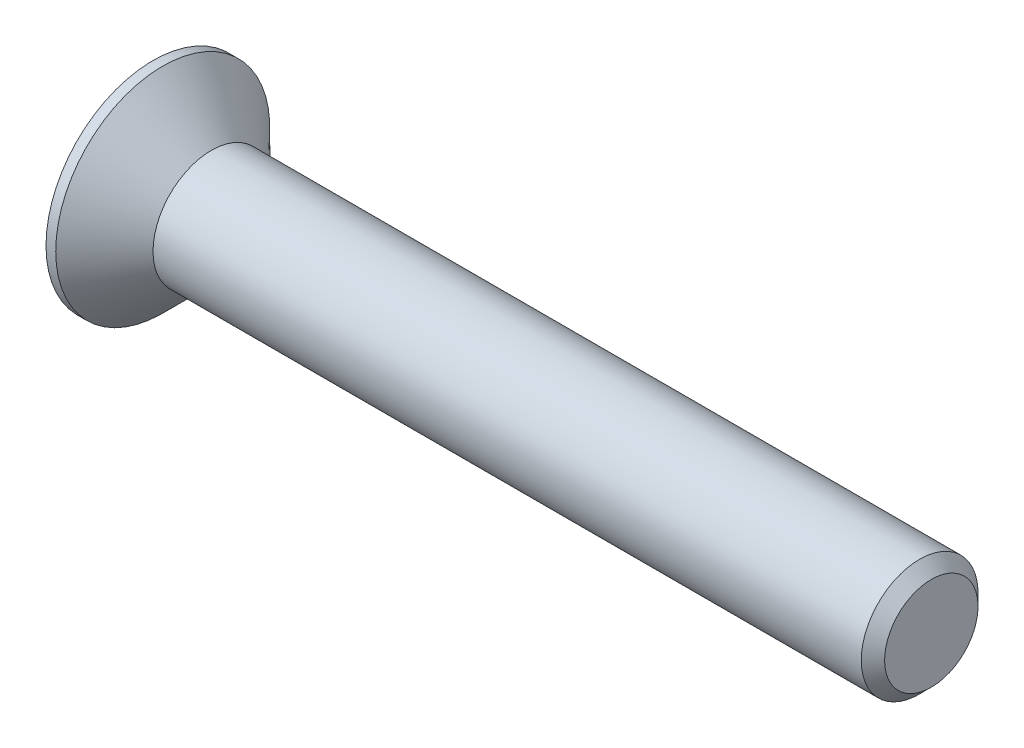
ISO-10303-21;
HEADER;
FILE_DESCRIPTION(('STEP AP214'),'2;1');
FILE_NAME('part.step','',(''),(''),'','','');
FILE_SCHEMA(('AUTOMOTIVE_DESIGN { 1 0 10303 214 1 1 1 1 }'));
ENDSEC;
DATA;
#1=APPLICATION_CONTEXT('core data for automotive mechanical design processes');
#2=APPLICATION_PROTOCOL_DEFINITION('international standard','automotive_design',2000,#1);
#3=PRODUCT_CONTEXT('',#1,'mechanical');
#4=PRODUCT('Part','Part','',(#3));
#5=PRODUCT_RELATED_PRODUCT_CATEGORY('part','',(#4));
#6=PRODUCT_DEFINITION_FORMATION('','',#4);
#7=PRODUCT_DEFINITION_CONTEXT('part definition',#1,'design');
#8=PRODUCT_DEFINITION('design','',#6,#7);
#9=PRODUCT_DEFINITION_SHAPE('','',#8);
#10=(LENGTH_UNIT() NAMED_UNIT(*) SI_UNIT(.MILLI.,.METRE.));
#11=(NAMED_UNIT(*) PLANE_ANGLE_UNIT() SI_UNIT($,.RADIAN.));
#12=(NAMED_UNIT(*) SI_UNIT($,.STERADIAN.) SOLID_ANGLE_UNIT());
#13=UNCERTAINTY_MEASURE_WITH_UNIT(LENGTH_MEASURE(1.E-05),#10,'distance_accuracy_value','');
#14=(GEOMETRIC_REPRESENTATION_CONTEXT(3) GLOBAL_UNCERTAINTY_ASSIGNED_CONTEXT((#13)) GLOBAL_UNIT_ASSIGNED_CONTEXT((#10,
#11,#12)) REPRESENTATION_CONTEXT('',''));
#15=CARTESIAN_POINT('',(0.,0.,0.));
#16=DIRECTION('',(0.,0.,1.));
#17=DIRECTION('',(1.,0.,0.));
#18=AXIS2_PLACEMENT_3D('',#15,#16,#17);
#19=CARTESIAN_POINT('',(0.,0.,0.));
#20=DIRECTION('',(-1.,0.,0.));
#21=DIRECTION('',(0.,0.,1.));
#22=AXIS2_PLACEMENT_3D('',#19,#20,#21);
#23=CONICAL_SURFACE('',#22,3.,0.78539816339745);
#24=CARTESIAN_POINT('',(-2.49999999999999,0.,0.));
#25=DIRECTION('',(-1.,0.,0.));
#26=DIRECTION('',(0.,0.,1.));
#27=AXIS2_PLACEMENT_3D('',#24,#25,#26);
#28=CIRCLE('',#27,5.5);
#29=CARTESIAN_POINT('',(-2.49999999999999,0.,5.5));
#30=VERTEX_POINT('',#29);
#31=EDGE_CURVE('E189',#30,#30,#28,.T.);
#32=ORIENTED_EDGE('',*,*,#31,.F.);
#33=EDGE_LOOP('',(#32));
#34=FACE_BOUND('',#33,.T.);
#35=CARTESIAN_POINT('',(0.,0.,0.));
#36=DIRECTION('',(-1.,0.,0.));
#37=DIRECTION('',(0.,0.,1.));
#38=AXIS2_PLACEMENT_3D('',#35,#36,#37);
#39=CIRCLE('',#38,3.);
#40=CARTESIAN_POINT('',(0.,0.,3.));
#41=VERTEX_POINT('',#40);
#42=EDGE_CURVE('E212',#41,#41,#39,.T.);
#43=ORIENTED_EDGE('',*,*,#42,.T.);
#44=EDGE_LOOP('',(#43));
#45=FACE_BOUND('',#44,.T.);
#46=ADVANCED_FACE('F33',(#34,#45),#23,.T.);
#47=CARTESIAN_POINT('',(-3.,0.,0.));
#48=DIRECTION('',(-1.,0.,0.));
#49=DIRECTION('',(0.,0.,1.));
#50=AXIS2_PLACEMENT_3D('',#47,#48,#49);
#51=CYLINDRICAL_SURFACE('',#50,3.);
#52=CARTESIAN_POINT('',(36.4,0.,0.));
#53=DIRECTION('',(-1.,0.,0.));
#54=DIRECTION('',(0.,0.,1.));
#55=AXIS2_PLACEMENT_3D('',#52,#53,#54);
#56=CIRCLE('',#55,3.);
#57=CARTESIAN_POINT('',(36.4,0.,3.));
#58=VERTEX_POINT('',#57);
#59=EDGE_CURVE('E41',#58,#58,#56,.T.);
#60=ORIENTED_EDGE('',*,*,#59,.T.);
#61=EDGE_LOOP('',(#60));
#62=FACE_BOUND('',#61,.T.);
#63=ORIENTED_EDGE('',*,*,#42,.F.);
#64=EDGE_LOOP('',(#63));
#65=FACE_BOUND('',#64,.T.);
#66=ADVANCED_FACE('F217',(#62,#65),#51,.T.);
#67=CARTESIAN_POINT('',(37.,0.,0.));
#68=DIRECTION('',(-1.,0.,0.));
#69=DIRECTION('',(0.,0.,1.));
#70=AXIS2_PLACEMENT_3D('',#67,#68,#69);
#71=PLANE('',#70);
#72=CARTESIAN_POINT('',(37.,0.,0.));
#73=DIRECTION('',(-1.,0.,0.));
#74=DIRECTION('',(0.,0.,1.));
#75=AXIS2_PLACEMENT_3D('',#72,#73,#74);
#76=CIRCLE('',#75,2.39999999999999);
#77=CARTESIAN_POINT('',(37.,0.,2.39999999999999));
#78=VERTEX_POINT('',#77);
#79=EDGE_CURVE('E11',#78,#78,#76,.F.);
#80=ORIENTED_EDGE('',*,*,#79,.T.);
#81=EDGE_LOOP('',(#80));
#82=FACE_BOUND('',#81,.T.);
#83=ADVANCED_FACE('F239',(#82),#71,.F.);
#84=CARTESIAN_POINT('',(-3.,5.5,0.));
#85=DIRECTION('',(1.,0.,0.));
#86=DIRECTION('',(0.,0.,-1.));
#87=AXIS2_PLACEMENT_3D('',#84,#85,#86);
#88=PLANE('',#87);
#89=DIRECTION('',(0.,0.,-1.));
#90=VECTOR('',#89,1.);
#91=CARTESIAN_POINT('',(-3.,0.825,-3.3));
#92=LINE('',#91,#90);
#93=CARTESIAN_POINT('',(-3.,0.825,-0.825));
#94=VERTEX_POINT('',#93);
#95=CARTESIAN_POINT('',(-3.,0.825,-3.3));
#96=VERTEX_POINT('',#95);
#97=EDGE_CURVE('E158',#94,#96,#92,.T.);
#98=ORIENTED_EDGE('',*,*,#97,.F.);
#99=DIRECTION('',(0.,-1.,0.));
#100=VECTOR('',#99,1.);
#101=CARTESIAN_POINT('',(-3.,0.825,-0.825));
#102=LINE('',#101,#100);
#103=CARTESIAN_POINT('',(-3.,3.3,-0.825));
#104=VERTEX_POINT('',#103);
#105=EDGE_CURVE('E48',#104,#94,#102,.T.);
#106=ORIENTED_EDGE('',*,*,#105,.F.);
#107=DIRECTION('',(0.,0.,-1.));
#108=VECTOR('',#107,1.);
#109=CARTESIAN_POINT('',(-3.,3.3,-0.825));
#110=LINE('',#109,#108);
#111=CARTESIAN_POINT('',(-3.,3.3,0.825));
#112=VERTEX_POINT('',#111);
#113=EDGE_CURVE('E185',#112,#104,#110,.T.);
#114=ORIENTED_EDGE('',*,*,#113,.F.);
#115=DIRECTION('',(0.,1.,0.));
#116=VECTOR('',#115,1.);
#117=CARTESIAN_POINT('',(-3.,3.3,0.825));
#118=LINE('',#117,#116);
#119=CARTESIAN_POINT('',(-3.,0.825,0.825));
#120=VERTEX_POINT('',#119);
#121=EDGE_CURVE('E183',#120,#112,#118,.T.);
#122=ORIENTED_EDGE('',*,*,#121,.F.);
#123=DIRECTION('',(0.,0.,-1.));
#124=VECTOR('',#123,1.);
#125=CARTESIAN_POINT('',(-3.,0.825,0.825));
#126=LINE('',#125,#124);
#127=CARTESIAN_POINT('',(-3.,0.825,3.3));
#128=VERTEX_POINT('',#127);
#129=EDGE_CURVE('E132',#128,#120,#126,.T.);
#130=ORIENTED_EDGE('',*,*,#129,.F.);
#131=DIRECTION('',(0.,1.,0.));
#132=VECTOR('',#131,1.);
#133=CARTESIAN_POINT('',(-3.,0.825,3.3));
#134=LINE('',#133,#132);
#135=CARTESIAN_POINT('',(-3.,-0.825,3.3));
#136=VERTEX_POINT('',#135);
#137=EDGE_CURVE('E179',#136,#128,#134,.T.);
#138=ORIENTED_EDGE('',*,*,#137,.F.);
#139=DIRECTION('',(0.,0.,1.));
#140=VECTOR('',#139,1.);
#141=CARTESIAN_POINT('',(-3.,-0.825,3.3));
#142=LINE('',#141,#140);
#143=CARTESIAN_POINT('',(-3.,-0.825,0.825));
#144=VERTEX_POINT('',#143);
#145=EDGE_CURVE('E176',#144,#136,#142,.T.);
#146=ORIENTED_EDGE('',*,*,#145,.F.);
#147=DIRECTION('',(0.,1.,0.));
#148=VECTOR('',#147,1.);
#149=CARTESIAN_POINT('',(-3.,-0.825,0.825));
#150=LINE('',#149,#148);
#151=CARTESIAN_POINT('',(-3.,-3.3,0.825));
#152=VERTEX_POINT('',#151);
#153=EDGE_CURVE('E173',#152,#144,#150,.T.);
#154=ORIENTED_EDGE('',*,*,#153,.F.);
#155=DIRECTION('',(0.,0.,1.));
#156=VECTOR('',#155,1.);
#157=CARTESIAN_POINT('',(-3.,-3.3,0.825));
#158=LINE('',#157,#156);
#159=CARTESIAN_POINT('',(-3.,-3.3,-0.825));
#160=VERTEX_POINT('',#159);
#161=EDGE_CURVE('E170',#160,#152,#158,.T.);
#162=ORIENTED_EDGE('',*,*,#161,.F.);
#163=DIRECTION('',(0.,-1.,0.));
#164=VECTOR('',#163,1.);
#165=CARTESIAN_POINT('',(-3.,-3.3,-0.825));
#166=LINE('',#165,#164);
#167=CARTESIAN_POINT('',(-3.,-0.825,-0.825));
#168=VERTEX_POINT('',#167);
#169=EDGE_CURVE('E167',#168,#160,#166,.T.);
#170=ORIENTED_EDGE('',*,*,#169,.F.);
#171=DIRECTION('',(0.,0.,1.));
#172=VECTOR('',#171,1.);
#173=CARTESIAN_POINT('',(-3.,-0.825,-0.825));
#174=LINE('',#173,#172);
#175=CARTESIAN_POINT('',(-3.,-0.825,-3.3));
#176=VERTEX_POINT('',#175);
#177=EDGE_CURVE('E164',#176,#168,#174,.T.);
#178=ORIENTED_EDGE('',*,*,#177,.F.);
#179=DIRECTION('',(0.,-1.,0.));
#180=VECTOR('',#179,1.);
#181=CARTESIAN_POINT('',(-3.,-0.825,-3.3));
#182=LINE('',#181,#180);
#183=EDGE_CURVE('E161',#96,#176,#182,.T.);
#184=ORIENTED_EDGE('',*,*,#183,.F.);
#185=EDGE_LOOP('',(#98,#106,#114,#122,#130,#138,#146,#154,#162,#170,#178,#184));
#186=FACE_BOUND('',#185,.T.);
#187=CARTESIAN_POINT('',(-3.,0.,0.));
#188=DIRECTION('',(-1.,0.,0.));
#189=DIRECTION('',(0.,0.,1.));
#190=AXIS2_PLACEMENT_3D('',#187,#188,#189);
#191=CIRCLE('',#190,5.5);
#192=CARTESIAN_POINT('',(-3.,0.,5.5));
#193=VERTEX_POINT('',#192);
#194=EDGE_CURVE('E209',#193,#193,#191,.T.);
#195=ORIENTED_EDGE('',*,*,#194,.T.);
#196=EDGE_LOOP('',(#195));
#197=FACE_BOUND('',#196,.T.);
#198=ADVANCED_FACE('F230',(#186,#197),#88,.F.);
#199=CARTESIAN_POINT('',(-3.,0.,0.));
#200=DIRECTION('',(-1.,0.,0.));
#201=DIRECTION('',(0.,0.,1.));
#202=AXIS2_PLACEMENT_3D('',#199,#200,#201);
#203=CYLINDRICAL_SURFACE('',#202,5.5);
#204=ORIENTED_EDGE('',*,*,#194,.F.);
#205=EDGE_LOOP('',(#204));
#206=FACE_BOUND('',#205,.T.);
#207=ORIENTED_EDGE('',*,*,#31,.T.);
#208=EDGE_LOOP('',(#207));
#209=FACE_BOUND('',#208,.T.);
#210=ADVANCED_FACE('F222',(#206,#209),#203,.T.);
#211=CARTESIAN_POINT('',(36.4,0.,0.));
#212=DIRECTION('',(-1.,0.,0.));
#213=DIRECTION('',(0.,0.,1.));
#214=AXIS2_PLACEMENT_3D('',#211,#212,#213);
#215=CONICAL_SURFACE('',#214,3.,0.785398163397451);
#216=ORIENTED_EDGE('',*,*,#79,.F.);
#217=EDGE_LOOP('',(#216));
#218=FACE_BOUND('',#217,.T.);
#219=ORIENTED_EDGE('',*,*,#59,.F.);
#220=EDGE_LOOP('',(#219));
#221=FACE_BOUND('',#220,.T.);
#222=ADVANCED_FACE('F35',(#218,#221),#215,.T.);
#223=CARTESIAN_POINT('',(-0.5,0.825,-0.825));
#224=DIRECTION('',(0.,0.,-1.));
#225=DIRECTION('',(-1.,0.,0.));
#226=AXIS2_PLACEMENT_3D('',#223,#224,#225);
#227=PLANE('',#226);
#228=ORIENTED_EDGE('',*,*,#105,.T.);
#229=DIRECTION('',(-1.,0.,0.));
#230=VECTOR('',#229,1.);
#231=CARTESIAN_POINT('',(-0.5,0.825,-0.825));
#232=LINE('',#231,#230);
#233=CARTESIAN_POINT('',(-0.5,0.825,-0.825));
#234=VERTEX_POINT('',#233);
#235=EDGE_CURVE('E96',#234,#94,#232,.T.);
#236=ORIENTED_EDGE('',*,*,#235,.F.);
#237=DIRECTION('',(0.,-1.,0.));
#238=VECTOR('',#237,1.);
#239=CARTESIAN_POINT('',(-0.5,0.825,-0.825));
#240=LINE('',#239,#238);
#241=CARTESIAN_POINT('',(-0.5,3.3,-0.825));
#242=VERTEX_POINT('',#241);
#243=EDGE_CURVE('E187',#242,#234,#240,.T.);
#244=ORIENTED_EDGE('',*,*,#243,.F.);
#245=DIRECTION('',(-1.,0.,0.));
#246=VECTOR('',#245,1.);
#247=CARTESIAN_POINT('',(-0.5,3.3,-0.825));
#248=LINE('',#247,#246);
#249=EDGE_CURVE('E56',#242,#104,#248,.T.);
#250=ORIENTED_EDGE('',*,*,#249,.T.);
#251=EDGE_LOOP('',(#228,#236,#244,#250));
#252=FACE_BOUND('',#251,.T.);
#253=ADVANCED_FACE('F221',(#252),#227,.F.);
#254=CARTESIAN_POINT('',(-0.5,3.3,-0.825));
#255=DIRECTION('',(0.,1.,0.));
#256=DIRECTION('',(-1.,0.,0.));
#257=AXIS2_PLACEMENT_3D('',#254,#255,#256);
#258=PLANE('',#257);
#259=ORIENTED_EDGE('',*,*,#113,.T.);
#260=ORIENTED_EDGE('',*,*,#249,.F.);
#261=DIRECTION('',(0.,0.,-1.));
#262=VECTOR('',#261,1.);
#263=CARTESIAN_POINT('',(-0.5,3.3,-0.825));
#264=LINE('',#263,#262);
#265=CARTESIAN_POINT('',(-0.5,3.3,0.825));
#266=VERTEX_POINT('',#265);
#267=EDGE_CURVE('E144',#266,#242,#264,.T.);
#268=ORIENTED_EDGE('',*,*,#267,.F.);
#269=DIRECTION('',(-1.,0.,0.));
#270=VECTOR('',#269,1.);
#271=CARTESIAN_POINT('',(-0.5,3.3,0.825));
#272=LINE('',#271,#270);
#273=EDGE_CURVE('E136',#266,#112,#272,.T.);
#274=ORIENTED_EDGE('',*,*,#273,.T.);
#275=EDGE_LOOP('',(#259,#260,#268,#274));
#276=FACE_BOUND('',#275,.T.);
#277=ADVANCED_FACE('F228',(#276),#258,.F.);
#278=CARTESIAN_POINT('',(-0.5,3.3,0.825));
#279=DIRECTION('',(0.,0.,1.));
#280=DIRECTION('',(1.,0.,0.));
#281=AXIS2_PLACEMENT_3D('',#278,#279,#280);
#282=PLANE('',#281);
#283=ORIENTED_EDGE('',*,*,#121,.T.);
#284=ORIENTED_EDGE('',*,*,#273,.F.);
#285=DIRECTION('',(0.,1.,0.));
#286=VECTOR('',#285,1.);
#287=CARTESIAN_POINT('',(-0.5,3.3,0.825));
#288=LINE('',#287,#286);
#289=CARTESIAN_POINT('',(-0.5,0.825,0.825));
#290=VERTEX_POINT('',#289);
#291=EDGE_CURVE('E140',#290,#266,#288,.T.);
#292=ORIENTED_EDGE('',*,*,#291,.F.);
#293=DIRECTION('',(-1.,0.,0.));
#294=VECTOR('',#293,1.);
#295=CARTESIAN_POINT('',(-0.5,0.825,0.825));
#296=LINE('',#295,#294);
#297=EDGE_CURVE('E125',#290,#120,#296,.T.);
#298=ORIENTED_EDGE('',*,*,#297,.T.);
#299=EDGE_LOOP('',(#283,#284,#292,#298));
#300=FACE_BOUND('',#299,.T.);
#301=ADVANCED_FACE('F141',(#300),#282,.F.);
#302=CARTESIAN_POINT('',(-0.5,0.825,0.825));
#303=DIRECTION('',(0.,1.,0.));
#304=DIRECTION('',(-1.,0.,0.));
#305=AXIS2_PLACEMENT_3D('',#302,#303,#304);
#306=PLANE('',#305);
#307=ORIENTED_EDGE('',*,*,#129,.T.);
#308=ORIENTED_EDGE('',*,*,#297,.F.);
#309=DIRECTION('',(0.,0.,-1.));
#310=VECTOR('',#309,1.);
#311=CARTESIAN_POINT('',(-0.5,0.825,0.825));
#312=LINE('',#311,#310);
#313=CARTESIAN_POINT('',(-0.5,0.825,3.3));
#314=VERTEX_POINT('',#313);
#315=EDGE_CURVE('E129',#314,#290,#312,.T.);
#316=ORIENTED_EDGE('',*,*,#315,.F.);
#317=DIRECTION('',(-1.,0.,0.));
#318=VECTOR('',#317,1.);
#319=CARTESIAN_POINT('',(-0.5,0.825,3.3));
#320=LINE('',#319,#318);
#321=EDGE_CURVE('E137',#314,#128,#320,.T.);
#322=ORIENTED_EDGE('',*,*,#321,.T.);
#323=EDGE_LOOP('',(#307,#308,#316,#322));
#324=FACE_BOUND('',#323,.T.);
#325=ADVANCED_FACE('F127',(#324),#306,.F.);
#326=CARTESIAN_POINT('',(-0.5,0.825,3.3));
#327=DIRECTION('',(0.,0.,1.));
#328=DIRECTION('',(1.,0.,0.));
#329=AXIS2_PLACEMENT_3D('',#326,#327,#328);
#330=PLANE('',#329);
#331=ORIENTED_EDGE('',*,*,#137,.T.);
#332=ORIENTED_EDGE('',*,*,#321,.F.);
#333=DIRECTION('',(0.,1.,0.));
#334=VECTOR('',#333,1.);
#335=CARTESIAN_POINT('',(-0.5,0.825,3.3));
#336=LINE('',#335,#334);
#337=CARTESIAN_POINT('',(-0.5,-0.825,3.3));
#338=VERTEX_POINT('',#337);
#339=EDGE_CURVE('E150',#338,#314,#336,.T.);
#340=ORIENTED_EDGE('',*,*,#339,.F.);
#341=DIRECTION('',(-1.,0.,0.));
#342=VECTOR('',#341,1.);
#343=CARTESIAN_POINT('',(-0.5,-0.825,3.3));
#344=LINE('',#343,#342);
#345=EDGE_CURVE('E192',#338,#136,#344,.T.);
#346=ORIENTED_EDGE('',*,*,#345,.T.);
#347=EDGE_LOOP('',(#331,#332,#340,#346));
#348=FACE_BOUND('',#347,.T.);
#349=ADVANCED_FACE('F277',(#348),#330,.F.);
#350=CARTESIAN_POINT('',(-0.5,-0.825,3.3));
#351=DIRECTION('',(0.,-1.,0.));
#352=DIRECTION('',(1.,0.,0.));
#353=AXIS2_PLACEMENT_3D('',#350,#351,#352);
#354=PLANE('',#353);
#355=ORIENTED_EDGE('',*,*,#145,.T.);
#356=ORIENTED_EDGE('',*,*,#345,.F.);
#357=DIRECTION('',(0.,0.,1.));
#358=VECTOR('',#357,1.);
#359=CARTESIAN_POINT('',(-0.5,-0.825,3.3));
#360=LINE('',#359,#358);
#361=CARTESIAN_POINT('',(-0.5,-0.825,0.825));
#362=VERTEX_POINT('',#361);
#363=EDGE_CURVE('E152',#362,#338,#360,.T.);
#364=ORIENTED_EDGE('',*,*,#363,.F.);
#365=DIRECTION('',(-1.,0.,0.));
#366=VECTOR('',#365,1.);
#367=CARTESIAN_POINT('',(-0.5,-0.825,0.825));
#368=LINE('',#367,#366);
#369=EDGE_CURVE('E194',#362,#144,#368,.T.);
#370=ORIENTED_EDGE('',*,*,#369,.T.);
#371=EDGE_LOOP('',(#355,#356,#364,#370));
#372=FACE_BOUND('',#371,.T.);
#373=ADVANCED_FACE('F273',(#372),#354,.F.);
#374=CARTESIAN_POINT('',(-0.5,-0.825,0.825));
#375=DIRECTION('',(0.,0.,1.));
#376=DIRECTION('',(1.,0.,0.));
#377=AXIS2_PLACEMENT_3D('',#374,#375,#376);
#378=PLANE('',#377);
#379=ORIENTED_EDGE('',*,*,#153,.T.);
#380=ORIENTED_EDGE('',*,*,#369,.F.);
#381=DIRECTION('',(0.,1.,0.));
#382=VECTOR('',#381,1.);
#383=CARTESIAN_POINT('',(-0.5,-0.825,0.825));
#384=LINE('',#383,#382);
#385=CARTESIAN_POINT('',(-0.5,-3.3,0.825));
#386=VERTEX_POINT('',#385);
#387=EDGE_CURVE('E422',#386,#362,#384,.T.);
#388=ORIENTED_EDGE('',*,*,#387,.F.);
#389=DIRECTION('',(-1.,0.,0.));
#390=VECTOR('',#389,1.);
#391=CARTESIAN_POINT('',(-0.5,-3.3,0.825));
#392=LINE('',#391,#390);
#393=EDGE_CURVE('E196',#386,#152,#392,.T.);
#394=ORIENTED_EDGE('',*,*,#393,.T.);
#395=EDGE_LOOP('',(#379,#380,#388,#394));
#396=FACE_BOUND('',#395,.T.);
#397=ADVANCED_FACE('F269',(#396),#378,.F.);
#398=CARTESIAN_POINT('',(-0.5,-3.3,0.825));
#399=DIRECTION('',(0.,-1.,0.));
#400=DIRECTION('',(1.,0.,0.));
#401=AXIS2_PLACEMENT_3D('',#398,#399,#400);
#402=PLANE('',#401);
#403=ORIENTED_EDGE('',*,*,#161,.T.);
#404=ORIENTED_EDGE('',*,*,#393,.F.);
#405=DIRECTION('',(0.,0.,1.));
#406=VECTOR('',#405,1.);
#407=CARTESIAN_POINT('',(-0.5,-3.3,0.825));
#408=LINE('',#407,#406);
#409=CARTESIAN_POINT('',(-0.5,-3.3,-0.825));
#410=VERTEX_POINT('',#409);
#411=EDGE_CURVE('E419',#410,#386,#408,.T.);
#412=ORIENTED_EDGE('',*,*,#411,.F.);
#413=DIRECTION('',(-1.,0.,0.));
#414=VECTOR('',#413,1.);
#415=CARTESIAN_POINT('',(-0.5,-3.3,-0.825));
#416=LINE('',#415,#414);
#417=EDGE_CURVE('E198',#410,#160,#416,.T.);
#418=ORIENTED_EDGE('',*,*,#417,.T.);
#419=EDGE_LOOP('',(#403,#404,#412,#418));
#420=FACE_BOUND('',#419,.T.);
#421=ADVANCED_FACE('F265',(#420),#402,.F.);
#422=CARTESIAN_POINT('',(-0.5,-3.3,-0.825));
#423=DIRECTION('',(0.,0.,-1.));
#424=DIRECTION('',(-1.,0.,0.));
#425=AXIS2_PLACEMENT_3D('',#422,#423,#424);
#426=PLANE('',#425);
#427=ORIENTED_EDGE('',*,*,#169,.T.);
#428=ORIENTED_EDGE('',*,*,#417,.F.);
#429=DIRECTION('',(0.,-1.,0.));
#430=VECTOR('',#429,1.);
#431=CARTESIAN_POINT('',(-0.5,-3.3,-0.825));
#432=LINE('',#431,#430);
#433=CARTESIAN_POINT('',(-0.5,-0.825,-0.825));
#434=VERTEX_POINT('',#433);
#435=EDGE_CURVE('E416',#434,#410,#432,.T.);
#436=ORIENTED_EDGE('',*,*,#435,.F.);
#437=DIRECTION('',(-1.,0.,0.));
#438=VECTOR('',#437,1.);
#439=CARTESIAN_POINT('',(-0.5,-0.825,-0.825));
#440=LINE('',#439,#438);
#441=EDGE_CURVE('E200',#434,#168,#440,.T.);
#442=ORIENTED_EDGE('',*,*,#441,.T.);
#443=EDGE_LOOP('',(#427,#428,#436,#442));
#444=FACE_BOUND('',#443,.T.);
#445=ADVANCED_FACE('F261',(#444),#426,.F.);
#446=CARTESIAN_POINT('',(-0.5,-0.825,-0.825));
#447=DIRECTION('',(0.,-1.,0.));
#448=DIRECTION('',(1.,0.,0.));
#449=AXIS2_PLACEMENT_3D('',#446,#447,#448);
#450=PLANE('',#449);
#451=ORIENTED_EDGE('',*,*,#177,.T.);
#452=ORIENTED_EDGE('',*,*,#441,.F.);
#453=DIRECTION('',(0.,0.,1.));
#454=VECTOR('',#453,1.);
#455=CARTESIAN_POINT('',(-0.5,-0.825,-0.825));
#456=LINE('',#455,#454);
#457=CARTESIAN_POINT('',(-0.5,-0.825,-3.3));
#458=VERTEX_POINT('',#457);
#459=EDGE_CURVE('E413',#458,#434,#456,.T.);
#460=ORIENTED_EDGE('',*,*,#459,.F.);
#461=DIRECTION('',(-1.,0.,0.));
#462=VECTOR('',#461,1.);
#463=CARTESIAN_POINT('',(-0.5,-0.825,-3.3));
#464=LINE('',#463,#462);
#465=EDGE_CURVE('E202',#458,#176,#464,.T.);
#466=ORIENTED_EDGE('',*,*,#465,.T.);
#467=EDGE_LOOP('',(#451,#452,#460,#466));
#468=FACE_BOUND('',#467,.T.);
#469=ADVANCED_FACE('F257',(#468),#450,.F.);
#470=CARTESIAN_POINT('',(-0.5,-0.825,-3.3));
#471=DIRECTION('',(0.,0.,-1.));
#472=DIRECTION('',(-1.,0.,0.));
#473=AXIS2_PLACEMENT_3D('',#470,#471,#472);
#474=PLANE('',#473);
#475=ORIENTED_EDGE('',*,*,#183,.T.);
#476=ORIENTED_EDGE('',*,*,#465,.F.);
#477=DIRECTION('',(0.,-1.,0.));
#478=VECTOR('',#477,1.);
#479=CARTESIAN_POINT('',(-0.5,-0.825,-3.3));
#480=LINE('',#479,#478);
#481=CARTESIAN_POINT('',(-0.5,0.825,-3.3));
#482=VERTEX_POINT('',#481);
#483=EDGE_CURVE('E408',#482,#458,#480,.T.);
#484=ORIENTED_EDGE('',*,*,#483,.F.);
#485=DIRECTION('',(-1.,0.,0.));
#486=VECTOR('',#485,1.);
#487=CARTESIAN_POINT('',(-0.5,0.825,-3.3));
#488=LINE('',#487,#486);
#489=EDGE_CURVE('E204',#482,#96,#488,.T.);
#490=ORIENTED_EDGE('',*,*,#489,.T.);
#491=EDGE_LOOP('',(#475,#476,#484,#490));
#492=FACE_BOUND('',#491,.T.);
#493=ADVANCED_FACE('F253',(#492),#474,.F.);
#494=CARTESIAN_POINT('',(-0.5,0.825,-3.3));
#495=DIRECTION('',(0.,1.,0.));
#496=DIRECTION('',(-1.,0.,0.));
#497=AXIS2_PLACEMENT_3D('',#494,#495,#496);
#498=PLANE('',#497);
#499=ORIENTED_EDGE('',*,*,#97,.T.);
#500=ORIENTED_EDGE('',*,*,#489,.F.);
#501=DIRECTION('',(0.,0.,-1.));
#502=VECTOR('',#501,1.);
#503=CARTESIAN_POINT('',(-0.5,0.825,-3.3));
#504=LINE('',#503,#502);
#505=EDGE_CURVE('E406',#234,#482,#504,.T.);
#506=ORIENTED_EDGE('',*,*,#505,.F.);
#507=ORIENTED_EDGE('',*,*,#235,.T.);
#508=EDGE_LOOP('',(#499,#500,#506,#507));
#509=FACE_BOUND('',#508,.T.);
#510=ADVANCED_FACE('F250',(#509),#498,.F.);
#511=CARTESIAN_POINT('',(-0.5,0.,0.));
#512=DIRECTION('',(1.,0.,0.));
#513=DIRECTION('',(0.,0.,-1.));
#514=AXIS2_PLACEMENT_3D('',#511,#512,#513);
#515=PLANE('',#514);
#516=ORIENTED_EDGE('',*,*,#243,.T.);
#517=ORIENTED_EDGE('',*,*,#505,.T.);
#518=ORIENTED_EDGE('',*,*,#483,.T.);
#519=ORIENTED_EDGE('',*,*,#459,.T.);
#520=ORIENTED_EDGE('',*,*,#435,.T.);
#521=ORIENTED_EDGE('',*,*,#411,.T.);
#522=ORIENTED_EDGE('',*,*,#387,.T.);
#523=ORIENTED_EDGE('',*,*,#363,.T.);
#524=ORIENTED_EDGE('',*,*,#339,.T.);
#525=ORIENTED_EDGE('',*,*,#315,.T.);
#526=ORIENTED_EDGE('',*,*,#291,.T.);
#527=ORIENTED_EDGE('',*,*,#267,.T.);
#528=EDGE_LOOP('',(#516,#517,#518,#519,#520,#521,#522,#523,#524,#525,#526,#527));
#529=FACE_BOUND('',#528,.T.);
#530=ADVANCED_FACE('F147',(#529),#515,.F.);
#531=CLOSED_SHELL('',(#46,#66,#83,#198,#210,#222,#253,#277,#301,#325,#349,#373,#397,#421,#445,
#469,#493,#510,#530));
#532=MANIFOLD_SOLID_BREP('B2',#531);
#533=ADVANCED_BREP_SHAPE_REPRESENTATION('',(#18,#532),#14);
#534=SHAPE_DEFINITION_REPRESENTATION(#9,#533);
ENDSEC;
END-ISO-10303-21;
